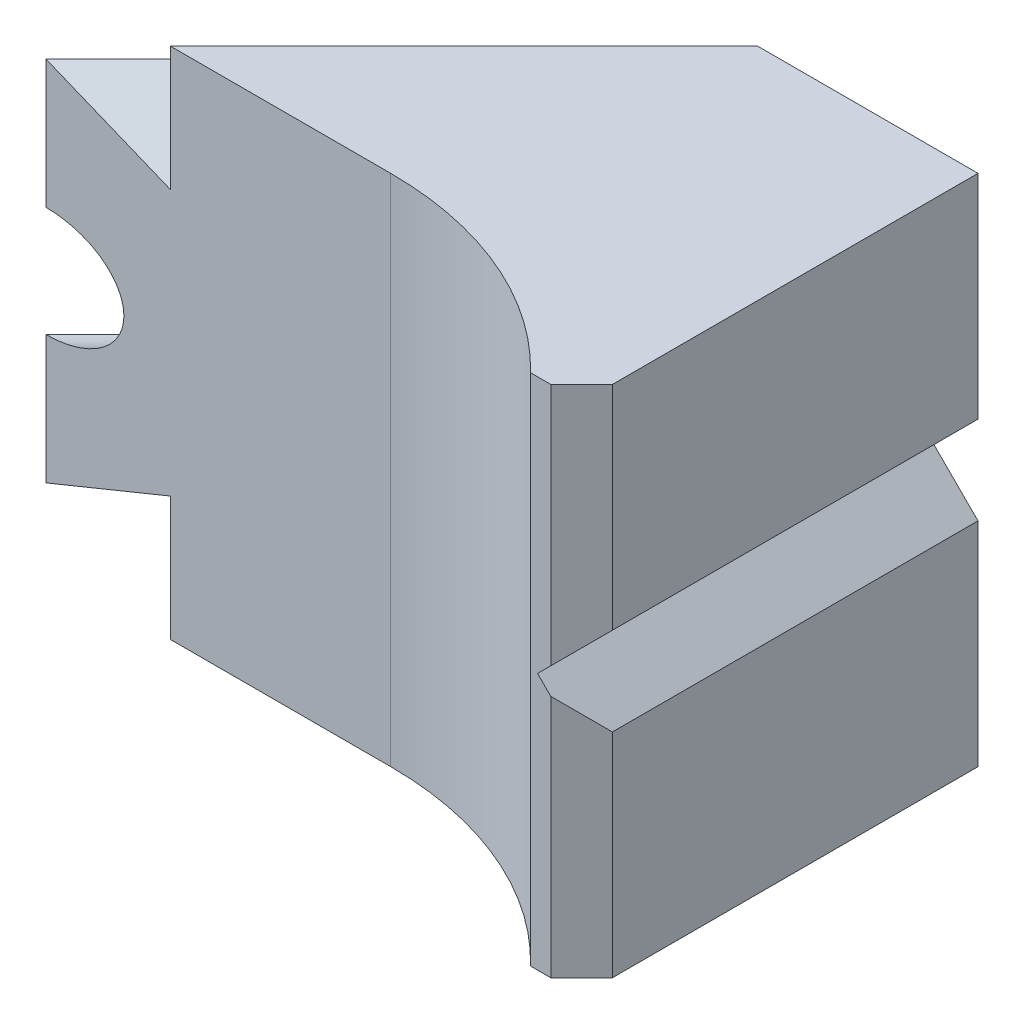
ISO-10303-21;
HEADER;
FILE_DESCRIPTION(('STEP AP214'),'2;1');
FILE_NAME('part.step','',(''),(''),'','','');
FILE_SCHEMA(('AUTOMOTIVE_DESIGN { 1 0 10303 214 1 1 1 1 }'));
ENDSEC;
DATA;
#1=APPLICATION_CONTEXT('core data for automotive mechanical design processes');
#2=APPLICATION_PROTOCOL_DEFINITION('international standard','automotive_design',2000,#1);
#3=PRODUCT_CONTEXT('',#1,'mechanical');
#4=PRODUCT('Part','Part','',(#3));
#5=PRODUCT_RELATED_PRODUCT_CATEGORY('part','',(#4));
#6=PRODUCT_DEFINITION_FORMATION('','',#4);
#7=PRODUCT_DEFINITION_CONTEXT('part definition',#1,'design');
#8=PRODUCT_DEFINITION('design','',#6,#7);
#9=PRODUCT_DEFINITION_SHAPE('','',#8);
#10=(LENGTH_UNIT() NAMED_UNIT(*) SI_UNIT(.MILLI.,.METRE.));
#11=(NAMED_UNIT(*) PLANE_ANGLE_UNIT() SI_UNIT($,.RADIAN.));
#12=(NAMED_UNIT(*) SI_UNIT($,.STERADIAN.) SOLID_ANGLE_UNIT());
#13=UNCERTAINTY_MEASURE_WITH_UNIT(LENGTH_MEASURE(1.E-05),#10,'distance_accuracy_value','');
#14=(GEOMETRIC_REPRESENTATION_CONTEXT(3) GLOBAL_UNCERTAINTY_ASSIGNED_CONTEXT((#13)) GLOBAL_UNIT_ASSIGNED_CONTEXT((#10,
#11,#12)) REPRESENTATION_CONTEXT('',''));
#15=CARTESIAN_POINT('',(0.,0.,0.));
#16=DIRECTION('',(0.,0.,1.));
#17=DIRECTION('',(1.,0.,0.));
#18=AXIS2_PLACEMENT_3D('',#15,#16,#17);
#19=CARTESIAN_POINT('',(-110.872998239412,9.03589838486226,119.358279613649));
#20=DIRECTION('',(-0.707106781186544,0.,-0.707106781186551));
#21=DIRECTION('',(0.707106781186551,0.,-0.707106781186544));
#22=AXIS2_PLACEMENT_3D('',#19,#20,#21);
#23=PLANE('',#22);
#24=DIRECTION('',(0.,1.,0.));
#25=VECTOR('',#24,1.);
#26=CARTESIAN_POINT('',(8.48528137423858,17.5,0.));
#27=LINE('',#26,#25);
#28=CARTESIAN_POINT('',(8.48528137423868,9.03589838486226,0.));
#29=VERTEX_POINT('',#28);
#30=CARTESIAN_POINT('',(8.48528137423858,17.5,0.));
#31=VERTEX_POINT('',#30);
#32=EDGE_CURVE('E219',#29,#31,#27,.T.);
#33=ORIENTED_EDGE('',*,*,#32,.F.);
#34=DIRECTION('',(0.707106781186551,0.,-0.707106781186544));
#35=VECTOR('',#34,1.);
#36=CARTESIAN_POINT('',(-110.872998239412,9.03589838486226,119.358279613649));
#37=LINE('',#36,#35);
#38=CARTESIAN_POINT('',(-11.5147186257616,9.03589838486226,20.));
#39=VERTEX_POINT('',#38);
#40=EDGE_CURVE('E209',#39,#29,#37,.T.);
#41=ORIENTED_EDGE('',*,*,#40,.F.);
#42=DIRECTION('',(0.,-1.,0.));
#43=VECTOR('',#42,1.);
#44=CARTESIAN_POINT('',(-11.5147186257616,17.5,20.));
#45=LINE('',#44,#43);
#46=CARTESIAN_POINT('',(-11.5147186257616,17.5,20.));
#47=VERTEX_POINT('',#46);
#48=EDGE_CURVE('E199',#47,#39,#45,.T.);
#49=ORIENTED_EDGE('',*,*,#48,.F.);
#50=DIRECTION('',(-0.707106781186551,0.,0.707106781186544));
#51=VECTOR('',#50,1.);
#52=CARTESIAN_POINT('',(-15.5173593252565,17.5,24.0026406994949));
#53=LINE('',#52,#51);
#54=EDGE_CURVE('E368',#31,#47,#53,.T.);
#55=ORIENTED_EDGE('',*,*,#54,.F.);
#56=EDGE_LOOP('',(#33,#41,#49,#55));
#57=FACE_BOUND('',#56,.T.);
#58=ADVANCED_FACE('F14',(#57),#23,.T.);
#59=CARTESIAN_POINT('',(-110.872998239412,9.03589838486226,119.358279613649));
#60=DIRECTION('',(0.353553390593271,0.86602540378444,0.353553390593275));
#61=DIRECTION('',(0.,0.377964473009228,-0.925820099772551));
#62=AXIS2_PLACEMENT_3D('',#59,#60,#61);
#63=PLANE('',#62);
#64=DIRECTION('',(0.925820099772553,-0.377964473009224,0.));
#65=VECTOR('',#64,1.);
#66=CARTESIAN_POINT('',(-1.74963555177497,13.2142857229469,0.));
#67=LINE('',#66,#65);
#68=CARTESIAN_POINT('',(0.,12.5,0.));
#69=VERTEX_POINT('',#68);
#70=EDGE_CURVE('E226',#69,#29,#67,.T.);
#71=ORIENTED_EDGE('',*,*,#70,.F.);
#72=DIRECTION('',(0.707106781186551,0.,-0.707106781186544));
#73=VECTOR('',#72,1.);
#74=CARTESIAN_POINT('',(-115.115638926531,12.5,115.11563892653));
#75=LINE('',#74,#73);
#76=CARTESIAN_POINT('',(-20.,12.5,20.));
#77=VERTEX_POINT('',#76);
#78=EDGE_CURVE('E205',#77,#69,#75,.T.);
#79=ORIENTED_EDGE('',*,*,#78,.F.);
#80=DIRECTION('',(-0.925820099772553,0.377964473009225,0.));
#81=VECTOR('',#80,1.);
#82=CARTESIAN_POINT('',(-1.62392126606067,4.9979972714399,20.));
#83=LINE('',#82,#81);
#84=EDGE_CURVE('E22',#39,#77,#83,.T.);
#85=ORIENTED_EDGE('',*,*,#84,.F.);
#86=ORIENTED_EDGE('',*,*,#40,.T.);
#87=EDGE_LOOP('',(#71,#79,#85,#86));
#88=FACE_BOUND('',#87,.T.);
#89=ADVANCED_FACE('F382',(#88),#63,.T.);
#90=CARTESIAN_POINT('',(-110.872998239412,-9.03589838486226,119.358279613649));
#91=DIRECTION('',(-0.707106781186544,0.,-0.707106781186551));
#92=DIRECTION('',(0.707106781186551,0.,-0.707106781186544));
#93=AXIS2_PLACEMENT_3D('',#90,#91,#92);
#94=PLANE('',#93);
#95=DIRECTION('',(0.,1.,0.));
#96=VECTOR('',#95,1.);
#97=CARTESIAN_POINT('',(8.48528137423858,17.5,0.));
#98=LINE('',#97,#96);
#99=CARTESIAN_POINT('',(8.48528137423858,-17.5,0.));
#100=VERTEX_POINT('',#99);
#101=CARTESIAN_POINT('',(8.48528137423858,-9.03589838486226,0.));
#102=VERTEX_POINT('',#101);
#103=EDGE_CURVE('E29',#100,#102,#98,.T.);
#104=ORIENTED_EDGE('',*,*,#103,.F.);
#105=DIRECTION('',(-0.707106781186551,0.,0.707106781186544));
#106=VECTOR('',#105,1.);
#107=CARTESIAN_POINT('',(-15.5173593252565,-17.5,24.0026406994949));
#108=LINE('',#107,#106);
#109=CARTESIAN_POINT('',(-11.5147186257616,-17.5,20.));
#110=VERTEX_POINT('',#109);
#111=EDGE_CURVE('E371',#100,#110,#108,.T.);
#112=ORIENTED_EDGE('',*,*,#111,.T.);
#113=DIRECTION('',(0.,-1.,0.));
#114=VECTOR('',#113,1.);
#115=CARTESIAN_POINT('',(-11.5147186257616,17.5,20.));
#116=LINE('',#115,#114);
#117=CARTESIAN_POINT('',(-11.5147186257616,-9.03589838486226,20.));
#118=VERTEX_POINT('',#117);
#119=EDGE_CURVE('E222',#118,#110,#116,.T.);
#120=ORIENTED_EDGE('',*,*,#119,.F.);
#121=DIRECTION('',(0.707106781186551,0.,-0.707106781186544));
#122=VECTOR('',#121,1.);
#123=CARTESIAN_POINT('',(-110.872998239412,-9.03589838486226,119.358279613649));
#124=LINE('',#123,#122);
#125=EDGE_CURVE('E200',#118,#102,#124,.T.);
#126=ORIENTED_EDGE('',*,*,#125,.T.);
#127=EDGE_LOOP('',(#104,#112,#120,#126));
#128=FACE_BOUND('',#127,.T.);
#129=ADVANCED_FACE('F395',(#128),#94,.T.);
#130=CARTESIAN_POINT('',(-110.872998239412,-9.03589838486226,119.358279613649));
#131=DIRECTION('',(0.353553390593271,-0.86602540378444,0.353553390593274));
#132=DIRECTION('',(0.,0.377964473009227,0.925820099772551));
#133=AXIS2_PLACEMENT_3D('',#130,#131,#132);
#134=PLANE('',#133);
#135=DIRECTION('',(-0.925820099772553,-0.377964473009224,0.));
#136=VECTOR('',#135,1.);
#137=CARTESIAN_POINT('',(10.4978131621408,-8.21428572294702,0.));
#138=LINE('',#137,#136);
#139=CARTESIAN_POINT('',(0.,-12.5,0.));
#140=VERTEX_POINT('',#139);
#141=EDGE_CURVE('E229',#102,#140,#138,.T.);
#142=ORIENTED_EDGE('',*,*,#141,.F.);
#143=ORIENTED_EDGE('',*,*,#125,.F.);
#144=DIRECTION('',(0.925820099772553,0.377964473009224,0.));
#145=VECTOR('',#144,1.);
#146=CARTESIAN_POINT('',(10.6235274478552,0.002002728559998,20.));
#147=LINE('',#146,#145);
#148=CARTESIAN_POINT('',(-20.,-12.5,20.));
#149=VERTEX_POINT('',#148);
#150=EDGE_CURVE('E9',#149,#118,#147,.T.);
#151=ORIENTED_EDGE('',*,*,#150,.F.);
#152=DIRECTION('',(0.707106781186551,0.,-0.707106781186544));
#153=VECTOR('',#152,1.);
#154=CARTESIAN_POINT('',(-115.115638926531,-12.5,115.11563892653));
#155=LINE('',#154,#153);
#156=EDGE_CURVE('E207',#149,#140,#155,.T.);
#157=ORIENTED_EDGE('',*,*,#156,.T.);
#158=EDGE_LOOP('',(#142,#143,#151,#157));
#159=FACE_BOUND('',#158,.T.);
#160=ADVANCED_FACE('F391',(#159),#134,.T.);
#161=CARTESIAN_POINT('',(-115.115638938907,0.,115.115638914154));
#162=DIRECTION('',(0.707106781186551,0.,-0.707106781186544));
#163=DIRECTION('',(0.707106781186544,0.,0.707106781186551));
#164=AXIS2_PLACEMENT_3D('',#161,#162,#163);
#165=CYLINDRICAL_SURFACE('',#164,6.9);
#166=DIRECTION('',(0.707106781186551,0.,-0.707106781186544));
#167=VECTOR('',#166,1.);
#168=CARTESIAN_POINT('',(-115.115638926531,6.9,115.11563892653));
#169=LINE('',#168,#167);
#170=CARTESIAN_POINT('',(-13.9895923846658,6.9,13.9895923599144));
#171=VERTEX_POINT('',#170);
#172=CARTESIAN_POINT('',(-4.09009743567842,6.9,4.09009743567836));
#173=VERTEX_POINT('',#172);
#174=EDGE_CURVE('E188',#171,#173,#169,.T.);
#175=ORIENTED_EDGE('',*,*,#174,.T.);
#176=CARTESIAN_POINT('',(-4.09009744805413,0.,4.09009742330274));
#177=DIRECTION('',(-0.707106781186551,0.,0.707106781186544));
#178=DIRECTION('',(-0.707106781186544,0.,-0.707106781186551));
#179=AXIS2_PLACEMENT_3D('',#176,#177,#178);
#180=CIRCLE('',#179,6.9);
#181=CARTESIAN_POINT('',(-4.09009743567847,-6.9,4.09009743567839));
#182=VERTEX_POINT('',#181);
#183=EDGE_CURVE('E196',#173,#182,#180,.T.);
#184=ORIENTED_EDGE('',*,*,#183,.T.);
#185=DIRECTION('',(0.707106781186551,0.,-0.707106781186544));
#186=VECTOR('',#185,1.);
#187=CARTESIAN_POINT('',(-115.115638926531,-6.9,115.11563892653));
#188=LINE('',#187,#186);
#189=CARTESIAN_POINT('',(-13.9895923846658,-6.9,13.9895923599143));
#190=VERTEX_POINT('',#189);
#191=EDGE_CURVE('E190',#190,#182,#188,.T.);
#192=ORIENTED_EDGE('',*,*,#191,.F.);
#193=CARTESIAN_POINT('',(-13.9895923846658,0.,13.9895923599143));
#194=DIRECTION('',(-0.707106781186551,0.,0.707106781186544));
#195=DIRECTION('',(-0.707106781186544,0.,-0.707106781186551));
#196=AXIS2_PLACEMENT_3D('',#193,#194,#195);
#197=CIRCLE('',#196,6.9);
#198=EDGE_CURVE('E204',#171,#190,#197,.T.);
#199=ORIENTED_EDGE('',*,*,#198,.F.);
#200=EDGE_LOOP('',(#175,#184,#192,#199));
#201=FACE_BOUND('',#200,.T.);
#202=ADVANCED_FACE('F203',(#201),#165,.T.);
#203=CARTESIAN_POINT('',(-2.47515272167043E-08,17.5,0.));
#204=DIRECTION('',(0.,0.,-1.));
#205=DIRECTION('',(-1.,0.,0.));
#206=AXIS2_PLACEMENT_3D('',#203,#204,#205);
#207=PLANE('',#206);
#208=DIRECTION('',(1.,0.,0.));
#209=VECTOR('',#208,1.);
#210=CARTESIAN_POINT('',(-2.47515272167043E-08,17.5,0.));
#211=LINE('',#210,#209);
#212=CARTESIAN_POINT('',(23.4799999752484,17.5,0.));
#213=VERTEX_POINT('',#212);
#214=EDGE_CURVE('E288',#31,#213,#211,.T.);
#215=ORIENTED_EDGE('',*,*,#214,.T.);
#216=DIRECTION('',(0.,-1.,0.));
#217=VECTOR('',#216,1.);
#218=CARTESIAN_POINT('',(23.4799999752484,17.5,0.));
#219=LINE('',#218,#217);
#220=CARTESIAN_POINT('',(23.4799999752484,3.00000000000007,0.));
#221=VERTEX_POINT('',#220);
#222=EDGE_CURVE('E296',#213,#221,#219,.T.);
#223=ORIENTED_EDGE('',*,*,#222,.T.);
#224=DIRECTION('',(-0.707106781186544,-0.707106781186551,0.));
#225=VECTOR('',#224,1.);
#226=CARTESIAN_POINT('',(23.4799999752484,3.00000000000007,0.));
#227=LINE('',#226,#225);
#228=CARTESIAN_POINT('',(20.4799999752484,0.,0.));
#229=VERTEX_POINT('',#228);
#230=EDGE_CURVE('E231',#221,#229,#227,.T.);
#231=ORIENTED_EDGE('',*,*,#230,.T.);
#232=DIRECTION('',(-0.707106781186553,0.707106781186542,0.));
#233=VECTOR('',#232,1.);
#234=CARTESIAN_POINT('',(23.4799999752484,-3.,0.));
#235=LINE('',#234,#233);
#236=CARTESIAN_POINT('',(23.4799999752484,-3.,0.));
#237=VERTEX_POINT('',#236);
#238=EDGE_CURVE('E232',#237,#229,#235,.T.);
#239=ORIENTED_EDGE('',*,*,#238,.F.);
#240=CARTESIAN_POINT('',(23.4799999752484,-17.5,0.));
#241=VERTEX_POINT('',#240);
#242=EDGE_CURVE('E295',#237,#241,#219,.T.);
#243=ORIENTED_EDGE('',*,*,#242,.T.);
#244=DIRECTION('',(1.,0.,0.));
#245=VECTOR('',#244,1.);
#246=CARTESIAN_POINT('',(-2.47515272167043E-08,-17.5,0.));
#247=LINE('',#246,#245);
#248=EDGE_CURVE('E272',#100,#241,#247,.T.);
#249=ORIENTED_EDGE('',*,*,#248,.F.);
#250=ORIENTED_EDGE('',*,*,#103,.T.);
#251=ORIENTED_EDGE('',*,*,#141,.T.);
#252=DIRECTION('',(0.,-1.,0.));
#253=VECTOR('',#252,1.);
#254=CARTESIAN_POINT('',(-2.47515272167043E-08,17.5,0.));
#255=LINE('',#254,#253);
#256=EDGE_CURVE('E37',#69,#140,#255,.T.);
#257=ORIENTED_EDGE('',*,*,#256,.F.);
#258=ORIENTED_EDGE('',*,*,#70,.T.);
#259=ORIENTED_EDGE('',*,*,#32,.T.);
#260=EDGE_LOOP('',(#215,#223,#231,#239,#243,#249,#250,#251,#257,#258,#259));
#261=FACE_BOUND('',#260,.T.);
#262=ADVANCED_FACE('F400',(#261),#207,.T.);
#263=CARTESIAN_POINT('',(3.47999997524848,17.5,20.));
#264=DIRECTION('',(0.,0.,1.));
#265=DIRECTION('',(1.,0.,0.));
#266=AXIS2_PLACEMENT_3D('',#263,#264,#265);
#267=PLANE('',#266);
#268=ORIENTED_EDGE('',*,*,#150,.T.);
#269=ORIENTED_EDGE('',*,*,#119,.T.);
#270=DIRECTION('',(-1.,0.,0.));
#271=VECTOR('',#270,1.);
#272=CARTESIAN_POINT('',(3.47999997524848,-17.5,20.));
#273=LINE('',#272,#271);
#274=CARTESIAN_POINT('',(3.47999997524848,-17.5,20.));
#275=VERTEX_POINT('',#274);
#276=EDGE_CURVE('E258',#275,#110,#273,.T.);
#277=ORIENTED_EDGE('',*,*,#276,.F.);
#278=DIRECTION('',(0.,-1.,0.));
#279=VECTOR('',#278,1.);
#280=CARTESIAN_POINT('',(3.47999997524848,17.5,20.));
#281=LINE('',#280,#279);
#282=CARTESIAN_POINT('',(3.47999997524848,17.5,20.));
#283=VERTEX_POINT('',#282);
#284=EDGE_CURVE('E309',#283,#275,#281,.T.);
#285=ORIENTED_EDGE('',*,*,#284,.F.);
#286=DIRECTION('',(-1.,0.,0.));
#287=VECTOR('',#286,1.);
#288=CARTESIAN_POINT('',(3.47999997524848,17.5,20.));
#289=LINE('',#288,#287);
#290=EDGE_CURVE('E262',#283,#47,#289,.T.);
#291=ORIENTED_EDGE('',*,*,#290,.T.);
#292=ORIENTED_EDGE('',*,*,#48,.T.);
#293=ORIENTED_EDGE('',*,*,#84,.T.);
#294=DIRECTION('',(0.,-1.,0.));
#295=VECTOR('',#294,1.);
#296=CARTESIAN_POINT('',(-20.0000000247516,17.5,20.));
#297=LINE('',#296,#295);
#298=CARTESIAN_POINT('',(-20.0000000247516,3.75,20.));
#299=VERTEX_POINT('',#298);
#300=EDGE_CURVE('E292',#77,#299,#297,.T.);
#301=ORIENTED_EDGE('',*,*,#300,.T.);
#302=CARTESIAN_POINT('',(-20.0000000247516,0.,20.));
#303=DIRECTION('',(0.,0.,1.));
#304=DIRECTION('',(-1.,0.,0.));
#305=AXIS2_PLACEMENT_3D('',#302,#303,#304);
#306=ELLIPSE('',#305,5.30330085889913,3.75);
#307=CARTESIAN_POINT('',(-20.0000000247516,-3.75,20.));
#308=VERTEX_POINT('',#307);
#309=EDGE_CURVE('E255',#308,#299,#306,.T.);
#310=ORIENTED_EDGE('',*,*,#309,.F.);
#311=EDGE_CURVE('E278',#308,#149,#297,.T.);
#312=ORIENTED_EDGE('',*,*,#311,.T.);
#313=EDGE_LOOP('',(#268,#269,#277,#285,#291,#292,#293,#301,#310,#312));
#314=FACE_BOUND('',#313,.T.);
#315=ADVANCED_FACE('F376',(#314),#267,.T.);
#316=CARTESIAN_POINT('',(3.47999997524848,-17.5,43.));
#317=DIRECTION('',(0.,1.,0.));
#318=DIRECTION('',(0.,0.,1.));
#319=AXIS2_PLACEMENT_3D('',#316,#317,#318);
#320=PLANE('',#319);
#321=ORIENTED_EDGE('',*,*,#248,.T.);
#322=DIRECTION('',(0.,0.,-1.));
#323=VECTOR('',#322,1.);
#324=CARTESIAN_POINT('',(23.4799999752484,-17.5,24.9));
#325=LINE('',#324,#323);
#326=CARTESIAN_POINT('',(23.4799999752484,-17.5,24.9));
#327=VERTEX_POINT('',#326);
#328=EDGE_CURVE('E269',#327,#241,#325,.T.);
#329=ORIENTED_EDGE('',*,*,#328,.F.);
#330=DIRECTION('',(-0.707106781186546,0.,0.707106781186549));
#331=VECTOR('',#330,1.);
#332=CARTESIAN_POINT('',(23.4799999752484,-17.5,24.9));
#333=LINE('',#332,#331);
#334=CARTESIAN_POINT('',(21.3799999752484,-17.5,27.));
#335=VERTEX_POINT('',#334);
#336=EDGE_CURVE('E266',#327,#335,#333,.T.);
#337=ORIENTED_EDGE('',*,*,#336,.T.);
#338=DIRECTION('',(-1.,0.,0.));
#339=VECTOR('',#338,1.);
#340=CARTESIAN_POINT('',(21.3799999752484,-17.5,27.));
#341=LINE('',#340,#339);
#342=CARTESIAN_POINT('',(20.0027116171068,-17.5,27.));
#343=VERTEX_POINT('',#342);
#344=EDGE_CURVE('E263',#335,#343,#341,.T.);
#345=ORIENTED_EDGE('',*,*,#344,.T.);
#346=CARTESIAN_POINT('',(3.47999997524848,-17.5,43.));
#347=DIRECTION('',(0.,1.,0.));
#348=DIRECTION('',(0.,0.,1.));
#349=AXIS2_PLACEMENT_3D('',#346,#347,#348);
#350=CIRCLE('',#349,23.);
#351=EDGE_CURVE('E259',#343,#275,#350,.T.);
#352=ORIENTED_EDGE('',*,*,#351,.T.);
#353=ORIENTED_EDGE('',*,*,#276,.T.);
#354=ORIENTED_EDGE('',*,*,#111,.F.);
#355=EDGE_LOOP('',(#321,#329,#337,#345,#352,#353,#354));
#356=FACE_BOUND('',#355,.T.);
#357=ADVANCED_FACE('F397',(#356),#320,.F.);
#358=CARTESIAN_POINT('',(3.47999997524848,17.5,43.));
#359=DIRECTION('',(0.,1.,0.));
#360=DIRECTION('',(0.,0.,1.));
#361=AXIS2_PLACEMENT_3D('',#358,#359,#360);
#362=PLANE('',#361);
#363=DIRECTION('',(-1.,0.,0.));
#364=VECTOR('',#363,1.);
#365=CARTESIAN_POINT('',(21.3799999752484,17.5,27.));
#366=LINE('',#365,#364);
#367=CARTESIAN_POINT('',(21.3799999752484,17.5,27.));
#368=VERTEX_POINT('',#367);
#369=CARTESIAN_POINT('',(20.0027116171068,17.5,27.));
#370=VERTEX_POINT('',#369);
#371=EDGE_CURVE('E279',#368,#370,#366,.T.);
#372=ORIENTED_EDGE('',*,*,#371,.F.);
#373=DIRECTION('',(-0.707106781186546,0.,0.707106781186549));
#374=VECTOR('',#373,1.);
#375=CARTESIAN_POINT('',(23.4799999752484,17.5,24.9));
#376=LINE('',#375,#374);
#377=CARTESIAN_POINT('',(23.4799999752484,17.5,24.9));
#378=VERTEX_POINT('',#377);
#379=EDGE_CURVE('E282',#378,#368,#376,.T.);
#380=ORIENTED_EDGE('',*,*,#379,.F.);
#381=DIRECTION('',(0.,0.,-1.));
#382=VECTOR('',#381,1.);
#383=CARTESIAN_POINT('',(23.4799999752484,17.5,24.9));
#384=LINE('',#383,#382);
#385=EDGE_CURVE('E285',#378,#213,#384,.T.);
#386=ORIENTED_EDGE('',*,*,#385,.T.);
#387=ORIENTED_EDGE('',*,*,#214,.F.);
#388=ORIENTED_EDGE('',*,*,#54,.T.);
#389=ORIENTED_EDGE('',*,*,#290,.F.);
#390=CARTESIAN_POINT('',(3.47999997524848,17.5,43.));
#391=DIRECTION('',(0.,1.,0.));
#392=DIRECTION('',(0.,0.,1.));
#393=AXIS2_PLACEMENT_3D('',#390,#391,#392);
#394=CIRCLE('',#393,23.);
#395=EDGE_CURVE('E275',#370,#283,#394,.T.);
#396=ORIENTED_EDGE('',*,*,#395,.F.);
#397=EDGE_LOOP('',(#372,#380,#386,#387,#388,#389,#396));
#398=FACE_BOUND('',#397,.T.);
#399=ADVANCED_FACE('F422',(#398),#362,.T.);
#400=CARTESIAN_POINT('',(-4.09009744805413,0.,4.09009742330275));
#401=DIRECTION('',(-0.707106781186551,0.,0.707106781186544));
#402=DIRECTION('',(0.707106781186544,0.,0.707106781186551));
#403=AXIS2_PLACEMENT_3D('',#400,#401,#402);
#404=PLANE('',#403);
#405=ORIENTED_EDGE('',*,*,#183,.F.);
#406=DIRECTION('',(0.,-1.,0.));
#407=VECTOR('',#406,1.);
#408=CARTESIAN_POINT('',(-4.09009744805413,17.5,4.09009742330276));
#409=LINE('',#408,#407);
#410=EDGE_CURVE('E182',#173,#182,#409,.T.);
#411=ORIENTED_EDGE('',*,*,#410,.T.);
#412=EDGE_LOOP('',(#405,#411));
#413=FACE_BOUND('',#412,.T.);
#414=ADVANCED_FACE('F197',(#413),#404,.F.);
#415=CARTESIAN_POINT('',(-13.9895923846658,0.,13.9895923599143));
#416=DIRECTION('',(-0.707106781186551,0.,0.707106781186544));
#417=DIRECTION('',(0.707106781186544,0.,0.707106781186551));
#418=AXIS2_PLACEMENT_3D('',#415,#416,#417);
#419=PLANE('',#418);
#420=DIRECTION('',(0.612372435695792,0.5,0.612372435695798));
#421=VECTOR('',#420,1.);
#422=CARTESIAN_POINT('',(-13.9895923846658,-3.46410161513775,13.9895923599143));
#423=LINE('',#422,#421);
#424=CARTESIAN_POINT('',(-13.9895923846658,-3.46410161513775,13.9895923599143));
#425=VERTEX_POINT('',#424);
#426=CARTESIAN_POINT('',(-11.8682720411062,-1.73205080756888,16.110912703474));
#427=VERTEX_POINT('',#426);
#428=EDGE_CURVE('E319',#425,#427,#423,.T.);
#429=ORIENTED_EDGE('',*,*,#428,.F.);
#430=DIRECTION('',(-0.61237243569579,0.5,-0.612372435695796));
#431=VECTOR('',#430,1.);
#432=CARTESIAN_POINT('',(-13.9895923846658,-3.46410161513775,13.9895923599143));
#433=LINE('',#432,#431);
#434=CARTESIAN_POINT('',(-16.1109127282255,-1.73205080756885,11.8682720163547));
#435=VERTEX_POINT('',#434);
#436=EDGE_CURVE('E318',#425,#435,#433,.T.);
#437=ORIENTED_EDGE('',*,*,#436,.T.);
#438=DIRECTION('',(0.,-1.,0.));
#439=VECTOR('',#438,1.);
#440=CARTESIAN_POINT('',(-16.1109127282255,1.73205080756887,11.8682720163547));
#441=LINE('',#440,#439);
#442=CARTESIAN_POINT('',(-16.1109127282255,1.73205080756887,11.8682720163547));
#443=VERTEX_POINT('',#442);
#444=EDGE_CURVE('E332',#443,#435,#441,.T.);
#445=ORIENTED_EDGE('',*,*,#444,.F.);
#446=DIRECTION('',(0.61237243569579,0.5,0.612372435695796));
#447=VECTOR('',#446,1.);
#448=CARTESIAN_POINT('',(-16.1109127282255,1.73205080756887,11.8682720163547));
#449=LINE('',#448,#447);
#450=CARTESIAN_POINT('',(-13.9895923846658,3.46410161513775,13.9895923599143));
#451=VERTEX_POINT('',#450);
#452=EDGE_CURVE('E329',#443,#451,#449,.T.);
#453=ORIENTED_EDGE('',*,*,#452,.T.);
#454=DIRECTION('',(-0.612372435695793,0.5,-0.612372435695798));
#455=VECTOR('',#454,1.);
#456=CARTESIAN_POINT('',(-11.8682720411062,1.73205080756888,16.110912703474));
#457=LINE('',#456,#455);
#458=CARTESIAN_POINT('',(-11.8682720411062,1.73205080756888,16.110912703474));
#459=VERTEX_POINT('',#458);
#460=EDGE_CURVE('E326',#459,#451,#457,.T.);
#461=ORIENTED_EDGE('',*,*,#460,.F.);
#462=DIRECTION('',(0.,1.,0.));
#463=VECTOR('',#462,1.);
#464=CARTESIAN_POINT('',(-11.8682720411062,-1.73205080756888,16.110912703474));
#465=LINE('',#464,#463);
#466=EDGE_CURVE('E323',#427,#459,#465,.T.);
#467=ORIENTED_EDGE('',*,*,#466,.F.);
#468=EDGE_LOOP('',(#429,#437,#445,#453,#461,#467));
#469=FACE_BOUND('',#468,.T.);
#470=DIRECTION('',(0.,1.,0.));
#471=VECTOR('',#470,1.);
#472=CARTESIAN_POINT('',(-13.9895923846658,17.5,13.9895923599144));
#473=LINE('',#472,#471);
#474=CARTESIAN_POINT('',(-13.9895923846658,3.75,13.9895923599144));
#475=VERTEX_POINT('',#474);
#476=EDGE_CURVE('E194',#475,#171,#473,.T.);
#477=ORIENTED_EDGE('',*,*,#476,.T.);
#478=ORIENTED_EDGE('',*,*,#198,.T.);
#479=CARTESIAN_POINT('',(-13.9895923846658,-3.75,13.9895923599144));
#480=VERTEX_POINT('',#479);
#481=EDGE_CURVE('E193',#190,#480,#473,.T.);
#482=ORIENTED_EDGE('',*,*,#481,.T.);
#483=CARTESIAN_POINT('',(-13.9895923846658,0.,13.9895923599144));
#484=DIRECTION('',(-0.707106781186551,0.,0.707106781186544));
#485=DIRECTION('',(0.707106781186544,0.,0.707106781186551));
#486=AXIS2_PLACEMENT_3D('',#483,#484,#485);
#487=CIRCLE('',#486,3.75);
#488=EDGE_CURVE('E252',#480,#475,#487,.T.);
#489=ORIENTED_EDGE('',*,*,#488,.T.);
#490=EDGE_LOOP('',(#477,#478,#482,#489));
#491=FACE_BOUND('',#490,.T.);
#492=ADVANCED_FACE('F16',(#469,#491),#419,.T.);
#493=CARTESIAN_POINT('',(-20.0000000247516,17.5,20.));
#494=DIRECTION('',(-0.707106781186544,0.,-0.707106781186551));
#495=DIRECTION('',(-0.707106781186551,0.,0.707106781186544));
#496=AXIS2_PLACEMENT_3D('',#493,#494,#495);
#497=PLANE('',#496);
#498=ORIENTED_EDGE('',*,*,#481,.F.);
#499=ORIENTED_EDGE('',*,*,#191,.T.);
#500=ORIENTED_EDGE('',*,*,#410,.F.);
#501=ORIENTED_EDGE('',*,*,#174,.F.);
#502=ORIENTED_EDGE('',*,*,#476,.F.);
#503=DIRECTION('',(-0.707106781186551,0.,0.707106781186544));
#504=VECTOR('',#503,1.);
#505=CARTESIAN_POINT('',(-24.1421356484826,3.75,24.142135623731));
#506=LINE('',#505,#504);
#507=EDGE_CURVE('E311',#299,#475,#506,.F.);
#508=ORIENTED_EDGE('',*,*,#507,.F.);
#509=ORIENTED_EDGE('',*,*,#300,.F.);
#510=ORIENTED_EDGE('',*,*,#78,.T.);
#511=ORIENTED_EDGE('',*,*,#256,.T.);
#512=ORIENTED_EDGE('',*,*,#156,.F.);
#513=ORIENTED_EDGE('',*,*,#311,.F.);
#514=DIRECTION('',(-0.707106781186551,0.,0.707106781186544));
#515=VECTOR('',#514,1.);
#516=CARTESIAN_POINT('',(-24.1421356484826,-3.75,24.142135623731));
#517=LINE('',#516,#515);
#518=EDGE_CURVE('E314',#480,#308,#517,.T.);
#519=ORIENTED_EDGE('',*,*,#518,.F.);
#520=EDGE_LOOP('',(#498,#499,#500,#501,#502,#508,#509,#510,#511,#512,#513,#519));
#521=FACE_BOUND('',#520,.T.);
#522=ADVANCED_FACE('F185',(#521),#497,.T.);
#523=CARTESIAN_POINT('',(21.3799999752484,17.5,27.));
#524=DIRECTION('',(0.,0.,1.));
#525=DIRECTION('',(1.,0.,0.));
#526=AXIS2_PLACEMENT_3D('',#523,#524,#525);
#527=PLANE('',#526);
#528=DIRECTION('',(-0.707106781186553,0.707106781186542,0.));
#529=VECTOR('',#528,1.);
#530=CARTESIAN_POINT('',(23.4799999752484,-3.,27.));
#531=LINE('',#530,#529);
#532=CARTESIAN_POINT('',(21.3799999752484,-0.900000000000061,27.));
#533=VERTEX_POINT('',#532);
#534=CARTESIAN_POINT('',(20.4799999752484,0.,27.));
#535=VERTEX_POINT('',#534);
#536=EDGE_CURVE('E237',#533,#535,#531,.T.);
#537=ORIENTED_EDGE('',*,*,#536,.T.);
#538=DIRECTION('',(-0.707106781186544,-0.707106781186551,0.));
#539=VECTOR('',#538,1.);
#540=CARTESIAN_POINT('',(23.4799999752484,3.00000000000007,27.));
#541=LINE('',#540,#539);
#542=CARTESIAN_POINT('',(21.3799999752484,0.900000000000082,27.));
#543=VERTEX_POINT('',#542);
#544=EDGE_CURVE('E235',#543,#535,#541,.T.);
#545=ORIENTED_EDGE('',*,*,#544,.F.);
#546=DIRECTION('',(0.,-1.,0.));
#547=VECTOR('',#546,1.);
#548=CARTESIAN_POINT('',(21.3799999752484,17.5,27.));
#549=LINE('',#548,#547);
#550=EDGE_CURVE('E304',#368,#543,#549,.T.);
#551=ORIENTED_EDGE('',*,*,#550,.F.);
#552=ORIENTED_EDGE('',*,*,#371,.T.);
#553=DIRECTION('',(0.,-1.,0.));
#554=VECTOR('',#553,1.);
#555=CARTESIAN_POINT('',(20.0027116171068,17.5,27.));
#556=LINE('',#555,#554);
#557=EDGE_CURVE('E307',#370,#343,#556,.T.);
#558=ORIENTED_EDGE('',*,*,#557,.T.);
#559=ORIENTED_EDGE('',*,*,#344,.F.);
#560=EDGE_CURVE('E303',#533,#335,#549,.T.);
#561=ORIENTED_EDGE('',*,*,#560,.F.);
#562=EDGE_LOOP('',(#537,#545,#551,#552,#558,#559,#561));
#563=FACE_BOUND('',#562,.T.);
#564=ADVANCED_FACE('F413',(#563),#527,.T.);
#565=CARTESIAN_POINT('',(23.4799999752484,17.5,24.9));
#566=DIRECTION('',(0.707106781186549,0.,0.707106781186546));
#567=DIRECTION('',(0.707106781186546,0.,-0.707106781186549));
#568=AXIS2_PLACEMENT_3D('',#565,#566,#567);
#569=PLANE('',#568);
#570=ORIENTED_EDGE('',*,*,#550,.T.);
#571=DIRECTION('',(0.577350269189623,0.577350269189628,-0.577350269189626));
#572=VECTOR('',#571,1.);
#573=CARTESIAN_POINT('',(28.3133333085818,7.83333333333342,20.0666666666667));
#574=LINE('',#573,#572);
#575=CARTESIAN_POINT('',(23.4799999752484,3.00000000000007,24.9));
#576=VERTEX_POINT('',#575);
#577=EDGE_CURVE('E249',#543,#576,#574,.T.);
#578=ORIENTED_EDGE('',*,*,#577,.T.);
#579=DIRECTION('',(0.,-1.,0.));
#580=VECTOR('',#579,1.);
#581=CARTESIAN_POINT('',(23.4799999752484,17.5,24.9));
#582=LINE('',#581,#580);
#583=EDGE_CURVE('E300',#378,#576,#582,.T.);
#584=ORIENTED_EDGE('',*,*,#583,.F.);
#585=ORIENTED_EDGE('',*,*,#379,.T.);
#586=EDGE_LOOP('',(#570,#578,#584,#585));
#587=FACE_BOUND('',#586,.T.);
#588=ADVANCED_FACE('F536',(#587),#569,.T.);
#589=CARTESIAN_POINT('',(23.4799999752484,17.5,24.9));
#590=DIRECTION('',(-1.,0.,0.));
#591=DIRECTION('',(0.,0.,1.));
#592=AXIS2_PLACEMENT_3D('',#589,#590,#591);
#593=PLANE('',#592);
#594=DIRECTION('',(0.,0.,-1.));
#595=VECTOR('',#594,1.);
#596=CARTESIAN_POINT('',(23.4799999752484,3.00000000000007,27.));
#597=LINE('',#596,#595);
#598=EDGE_CURVE('E244',#576,#221,#597,.T.);
#599=ORIENTED_EDGE('',*,*,#598,.T.);
#600=ORIENTED_EDGE('',*,*,#222,.F.);
#601=ORIENTED_EDGE('',*,*,#385,.F.);
#602=ORIENTED_EDGE('',*,*,#583,.T.);
#603=EDGE_LOOP('',(#599,#600,#601,#602));
#604=FACE_BOUND('',#603,.T.);
#605=ADVANCED_FACE('F429',(#604),#593,.F.);
#606=CARTESIAN_POINT('',(3.47999997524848,17.5,43.));
#607=DIRECTION('',(0.,-1.,0.));
#608=DIRECTION('',(0.,0.,-1.));
#609=AXIS2_PLACEMENT_3D('',#606,#607,#608);
#610=CYLINDRICAL_SURFACE('',#609,23.);
#611=ORIENTED_EDGE('',*,*,#557,.F.);
#612=ORIENTED_EDGE('',*,*,#395,.T.);
#613=ORIENTED_EDGE('',*,*,#284,.T.);
#614=ORIENTED_EDGE('',*,*,#351,.F.);
#615=EDGE_LOOP('',(#611,#612,#613,#614));
#616=FACE_BOUND('',#615,.T.);
#617=ADVANCED_FACE('F417',(#616),#610,.F.);
#618=DIRECTION('',(0.577350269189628,-0.577350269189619,-0.577350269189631));
#619=VECTOR('',#618,1.);
#620=CARTESIAN_POINT('',(16.6466666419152,3.83333333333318,31.7333333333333));
#621=LINE('',#620,#619);
#622=CARTESIAN_POINT('',(23.4799999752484,-3.,24.9));
#623=VERTEX_POINT('',#622);
#624=EDGE_CURVE('E246',#533,#623,#621,.T.);
#625=ORIENTED_EDGE('',*,*,#624,.F.);
#626=ORIENTED_EDGE('',*,*,#560,.T.);
#627=ORIENTED_EDGE('',*,*,#336,.F.);
#628=EDGE_CURVE('E299',#623,#327,#582,.T.);
#629=ORIENTED_EDGE('',*,*,#628,.F.);
#630=EDGE_LOOP('',(#625,#626,#627,#629));
#631=FACE_BOUND('',#630,.T.);
#632=ADVANCED_FACE('F410',(#631),#569,.T.);
#633=ORIENTED_EDGE('',*,*,#328,.T.);
#634=ORIENTED_EDGE('',*,*,#242,.F.);
#635=DIRECTION('',(0.,0.,1.));
#636=VECTOR('',#635,1.);
#637=CARTESIAN_POINT('',(23.4799999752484,-3.,0.70000000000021));
#638=LINE('',#637,#636);
#639=EDGE_CURVE('E316',#237,#623,#638,.T.);
#640=ORIENTED_EDGE('',*,*,#639,.T.);
#641=ORIENTED_EDGE('',*,*,#628,.T.);
#642=EDGE_LOOP('',(#633,#634,#640,#641));
#643=FACE_BOUND('',#642,.T.);
#644=ADVANCED_FACE('F404',(#643),#593,.F.);
#645=CARTESIAN_POINT('',(-24.1421356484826,0.,24.142135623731));
#646=DIRECTION('',(-0.707106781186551,0.,0.707106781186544));
#647=DIRECTION('',(0.707106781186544,0.,0.707106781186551));
#648=AXIS2_PLACEMENT_3D('',#645,#646,#647);
#649=CYLINDRICAL_SURFACE('',#648,3.75);
#650=ORIENTED_EDGE('',*,*,#518,.T.);
#651=ORIENTED_EDGE('',*,*,#309,.T.);
#652=ORIENTED_EDGE('',*,*,#507,.T.);
#653=ORIENTED_EDGE('',*,*,#488,.F.);
#654=EDGE_LOOP('',(#650,#651,#652,#653));
#655=FACE_BOUND('',#654,.T.);
#656=ADVANCED_FACE('F386',(#655),#649,.F.);
#657=CARTESIAN_POINT('',(23.4799999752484,3.00000000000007,27.));
#658=DIRECTION('',(0.707106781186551,-0.707106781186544,0.));
#659=DIRECTION('',(0.707106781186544,0.707106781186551,0.));
#660=AXIS2_PLACEMENT_3D('',#657,#658,#659);
#661=PLANE('',#660);
#662=ORIENTED_EDGE('',*,*,#230,.F.);
#663=ORIENTED_EDGE('',*,*,#598,.F.);
#664=ORIENTED_EDGE('',*,*,#577,.F.);
#665=ORIENTED_EDGE('',*,*,#544,.T.);
#666=DIRECTION('',(0.,0.,-1.));
#667=VECTOR('',#666,1.);
#668=CARTESIAN_POINT('',(20.4799999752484,0.,27.));
#669=LINE('',#668,#667);
#670=EDGE_CURVE('E240',#535,#229,#669,.T.);
#671=ORIENTED_EDGE('',*,*,#670,.T.);
#672=EDGE_LOOP('',(#662,#663,#664,#665,#671));
#673=FACE_BOUND('',#672,.T.);
#674=ADVANCED_FACE('F432',(#673),#661,.T.);
#675=CARTESIAN_POINT('',(23.4799999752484,-3.,27.));
#676=DIRECTION('',(-0.707106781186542,-0.707106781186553,0.));
#677=DIRECTION('',(0.707106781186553,-0.707106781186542,0.));
#678=AXIS2_PLACEMENT_3D('',#675,#676,#677);
#679=PLANE('',#678);
#680=ORIENTED_EDGE('',*,*,#624,.T.);
#681=ORIENTED_EDGE('',*,*,#639,.F.);
#682=ORIENTED_EDGE('',*,*,#238,.T.);
#683=ORIENTED_EDGE('',*,*,#670,.F.);
#684=ORIENTED_EDGE('',*,*,#536,.F.);
#685=EDGE_LOOP('',(#680,#681,#682,#683,#684));
#686=FACE_BOUND('',#685,.T.);
#687=ADVANCED_FACE('F435',(#686),#679,.F.);
#688=CARTESIAN_POINT('',(-13.9895923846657,0.,5.5043109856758));
#689=DIRECTION('',(0.707106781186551,0.,-0.707106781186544));
#690=DIRECTION('',(-0.707106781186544,0.,-0.707106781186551));
#691=AXIS2_PLACEMENT_3D('',#688,#689,#690);
#692=PLANE('',#691);
#693=DIRECTION('',(-0.61237243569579,0.5,-0.612372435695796));
#694=VECTOR('',#693,1.);
#695=CARTESIAN_POINT('',(-9.74695169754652,-3.46410161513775,9.7469516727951));
#696=LINE('',#695,#694);
#697=CARTESIAN_POINT('',(-9.74695169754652,-3.46410161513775,9.7469516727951));
#698=VERTEX_POINT('',#697);
#699=CARTESIAN_POINT('',(-11.8682720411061,-1.73205080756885,7.62563132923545));
#700=VERTEX_POINT('',#699);
#701=EDGE_CURVE('E322',#698,#700,#696,.T.);
#702=ORIENTED_EDGE('',*,*,#701,.F.);
#703=DIRECTION('',(0.612372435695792,0.5,0.612372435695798));
#704=VECTOR('',#703,1.);
#705=CARTESIAN_POINT('',(-9.74695169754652,-3.46410161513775,9.7469516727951));
#706=LINE('',#705,#704);
#707=CARTESIAN_POINT('',(-7.62563135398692,-1.73205080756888,11.8682720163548));
#708=VERTEX_POINT('',#707);
#709=EDGE_CURVE('E337',#698,#708,#706,.T.);
#710=ORIENTED_EDGE('',*,*,#709,.T.);
#711=DIRECTION('',(0.,1.,0.));
#712=VECTOR('',#711,1.);
#713=CARTESIAN_POINT('',(-7.62563135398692,-1.73205080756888,11.8682720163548));
#714=LINE('',#713,#712);
#715=CARTESIAN_POINT('',(-7.62563135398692,1.73205080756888,11.8682720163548));
#716=VERTEX_POINT('',#715);
#717=EDGE_CURVE('E341',#708,#716,#714,.T.);
#718=ORIENTED_EDGE('',*,*,#717,.T.);
#719=DIRECTION('',(-0.612372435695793,0.5,-0.612372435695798));
#720=VECTOR('',#719,1.);
#721=CARTESIAN_POINT('',(-7.62563135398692,1.73205080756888,11.8682720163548));
#722=LINE('',#721,#720);
#723=CARTESIAN_POINT('',(-9.74695169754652,3.46410161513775,9.7469516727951));
#724=VERTEX_POINT('',#723);
#725=EDGE_CURVE('E344',#716,#724,#722,.T.);
#726=ORIENTED_EDGE('',*,*,#725,.T.);
#727=DIRECTION('',(0.61237243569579,0.5,0.612372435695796));
#728=VECTOR('',#727,1.);
#729=CARTESIAN_POINT('',(-11.8682720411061,1.73205080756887,7.62563132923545));
#730=LINE('',#729,#728);
#731=CARTESIAN_POINT('',(-11.8682720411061,1.73205080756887,7.62563132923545));
#732=VERTEX_POINT('',#731);
#733=EDGE_CURVE('E347',#732,#724,#730,.T.);
#734=ORIENTED_EDGE('',*,*,#733,.F.);
#735=DIRECTION('',(0.,-1.,0.));
#736=VECTOR('',#735,1.);
#737=CARTESIAN_POINT('',(-11.8682720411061,1.73205080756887,7.62563132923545));
#738=LINE('',#737,#736);
#739=EDGE_CURVE('E350',#732,#700,#738,.T.);
#740=ORIENTED_EDGE('',*,*,#739,.T.);
#741=EDGE_LOOP('',(#702,#710,#718,#726,#734,#740));
#742=FACE_BOUND('',#741,.T.);
#743=ADVANCED_FACE('F437',(#742),#692,.F.);
#744=CARTESIAN_POINT('',(-9.74695169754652,-3.46410161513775,9.7469516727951));
#745=DIRECTION('',(0.353553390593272,-0.866025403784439,0.353553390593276));
#746=DIRECTION('',(0.612372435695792,0.5,0.612372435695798));
#747=AXIS2_PLACEMENT_3D('',#744,#745,#746);
#748=PLANE('',#747);
#749=ORIENTED_EDGE('',*,*,#709,.F.);
#750=DIRECTION('',(-0.707106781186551,0.,0.707106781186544));
#751=VECTOR('',#750,1.);
#752=CARTESIAN_POINT('',(-9.74695169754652,-3.46410161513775,9.7469516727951));
#753=LINE('',#752,#751);
#754=EDGE_CURVE('E340',#698,#425,#753,.T.);
#755=ORIENTED_EDGE('',*,*,#754,.T.);
#756=ORIENTED_EDGE('',*,*,#428,.T.);
#757=DIRECTION('',(-0.707106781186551,0.,0.707106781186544));
#758=VECTOR('',#757,1.);
#759=CARTESIAN_POINT('',(-7.62563135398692,-1.73205080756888,11.8682720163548));
#760=LINE('',#759,#758);
#761=EDGE_CURVE('E357',#708,#427,#760,.T.);
#762=ORIENTED_EDGE('',*,*,#761,.F.);
#763=EDGE_LOOP('',(#749,#755,#756,#762));
#764=FACE_BOUND('',#763,.T.);
#765=ADVANCED_FACE('F445',(#764),#748,.F.);
#766=CARTESIAN_POINT('',(-7.62563135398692,-1.73205080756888,11.8682720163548));
#767=DIRECTION('',(0.707106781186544,0.,0.707106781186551));
#768=DIRECTION('',(0.707106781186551,0.,-0.707106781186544));
#769=AXIS2_PLACEMENT_3D('',#766,#767,#768);
#770=PLANE('',#769);
#771=ORIENTED_EDGE('',*,*,#761,.T.);
#772=ORIENTED_EDGE('',*,*,#466,.T.);
#773=DIRECTION('',(-0.707106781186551,0.,0.707106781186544));
#774=VECTOR('',#773,1.);
#775=CARTESIAN_POINT('',(-7.62563135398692,1.73205080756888,11.8682720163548));
#776=LINE('',#775,#774);
#777=EDGE_CURVE('E359',#716,#459,#776,.T.);
#778=ORIENTED_EDGE('',*,*,#777,.F.);
#779=ORIENTED_EDGE('',*,*,#717,.F.);
#780=EDGE_LOOP('',(#771,#772,#778,#779));
#781=FACE_BOUND('',#780,.T.);
#782=ADVANCED_FACE('F628',(#781),#770,.F.);
#783=CARTESIAN_POINT('',(-7.62563135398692,1.73205080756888,11.8682720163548));
#784=DIRECTION('',(0.353553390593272,0.86602540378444,0.353553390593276));
#785=DIRECTION('',(-0.612372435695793,0.5,-0.612372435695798));
#786=AXIS2_PLACEMENT_3D('',#783,#784,#785);
#787=PLANE('',#786);
#788=ORIENTED_EDGE('',*,*,#777,.T.);
#789=ORIENTED_EDGE('',*,*,#460,.T.);
#790=DIRECTION('',(-0.707106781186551,0.,0.707106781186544));
#791=VECTOR('',#790,1.);
#792=CARTESIAN_POINT('',(-9.74695169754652,3.46410161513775,9.7469516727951));
#793=LINE('',#792,#791);
#794=EDGE_CURVE('E361',#724,#451,#793,.T.);
#795=ORIENTED_EDGE('',*,*,#794,.F.);
#796=ORIENTED_EDGE('',*,*,#725,.F.);
#797=EDGE_LOOP('',(#788,#789,#795,#796));
#798=FACE_BOUND('',#797,.T.);
#799=ADVANCED_FACE('F636',(#798),#787,.F.);
#800=CARTESIAN_POINT('',(-11.8682720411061,1.73205080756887,7.62563132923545));
#801=DIRECTION('',(0.353553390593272,-0.866025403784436,0.353553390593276));
#802=DIRECTION('',(0.612372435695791,0.5,0.612372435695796));
#803=AXIS2_PLACEMENT_3D('',#800,#801,#802);
#804=PLANE('',#803);
#805=ORIENTED_EDGE('',*,*,#794,.T.);
#806=ORIENTED_EDGE('',*,*,#452,.F.);
#807=DIRECTION('',(-0.707106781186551,0.,0.707106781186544));
#808=VECTOR('',#807,1.);
#809=CARTESIAN_POINT('',(-11.8682720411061,1.73205080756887,7.62563132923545));
#810=LINE('',#809,#808);
#811=EDGE_CURVE('E363',#732,#443,#810,.T.);
#812=ORIENTED_EDGE('',*,*,#811,.F.);
#813=ORIENTED_EDGE('',*,*,#733,.T.);
#814=EDGE_LOOP('',(#805,#806,#812,#813));
#815=FACE_BOUND('',#814,.T.);
#816=ADVANCED_FACE('F645',(#815),#804,.T.);
#817=CARTESIAN_POINT('',(-11.8682720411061,1.73205080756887,7.62563132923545));
#818=DIRECTION('',(-0.707106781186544,0.,-0.707106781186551));
#819=DIRECTION('',(0.,-1.,0.));
#820=AXIS2_PLACEMENT_3D('',#817,#818,#819);
#821=PLANE('',#820);
#822=ORIENTED_EDGE('',*,*,#811,.T.);
#823=ORIENTED_EDGE('',*,*,#444,.T.);
#824=DIRECTION('',(-0.707106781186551,0.,0.707106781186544));
#825=VECTOR('',#824,1.);
#826=CARTESIAN_POINT('',(-11.8682720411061,-1.73205080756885,7.62563132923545));
#827=LINE('',#826,#825);
#828=EDGE_CURVE('E365',#700,#435,#827,.T.);
#829=ORIENTED_EDGE('',*,*,#828,.F.);
#830=ORIENTED_EDGE('',*,*,#739,.F.);
#831=EDGE_LOOP('',(#822,#823,#829,#830));
#832=FACE_BOUND('',#831,.T.);
#833=ADVANCED_FACE('F654',(#832),#821,.F.);
#834=CARTESIAN_POINT('',(-9.74695169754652,-3.46410161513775,9.7469516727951));
#835=DIRECTION('',(0.353553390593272,0.866025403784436,0.353553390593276));
#836=DIRECTION('',(-0.61237243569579,0.5,-0.612372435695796));
#837=AXIS2_PLACEMENT_3D('',#834,#835,#836);
#838=PLANE('',#837);
#839=ORIENTED_EDGE('',*,*,#828,.T.);
#840=ORIENTED_EDGE('',*,*,#436,.F.);
#841=ORIENTED_EDGE('',*,*,#754,.F.);
#842=ORIENTED_EDGE('',*,*,#701,.T.);
#843=EDGE_LOOP('',(#839,#840,#841,#842));
#844=FACE_BOUND('',#843,.T.);
#845=ADVANCED_FACE('F663',(#844),#838,.T.);
#846=CLOSED_SHELL('',(#58,#89,#129,#160,#202,#262,#315,#357,#399,#414,#492,#522,#564,#588,#605,
#617,#632,#644,#656,#674,#687,#743,#765,#782,#799,#816,#833,#845));
#847=MANIFOLD_SOLID_BREP('B1',#846);
#848=ADVANCED_BREP_SHAPE_REPRESENTATION('',(#18,#847),#14);
#849=SHAPE_DEFINITION_REPRESENTATION(#9,#848);
ENDSEC;
END-ISO-10303-21;
